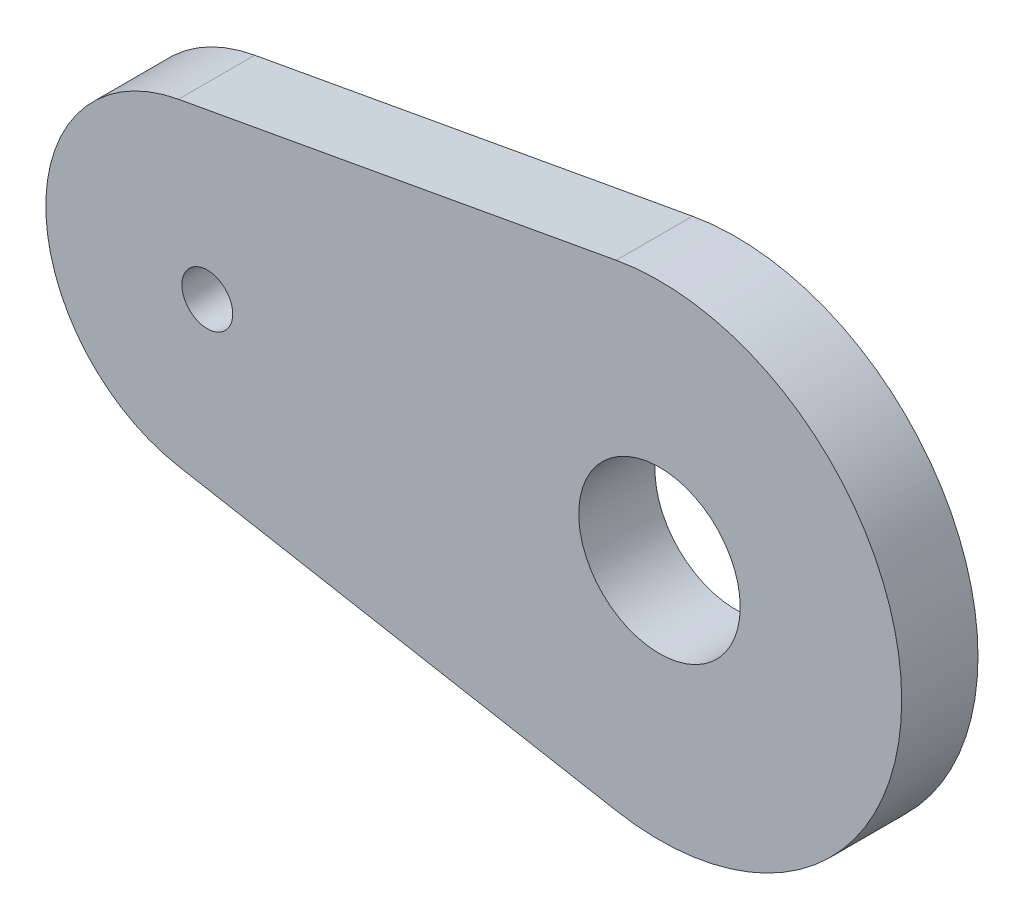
from build123d import *

# Parameters (mm, degrees)
SKETCH1_R           = 1
SKETCH1_R_2         = 3.175
BOSS_EXTRUDE1_DEPTH = 3


with BuildPart() as part:
    # Sketch1 → Boss-Extrude1 (new body)
    with BuildSketch(Plane.XY):
        with BuildLine():
            Line((-1.133928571, 6.247936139), (16.079107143, 9.371904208))
            ThreePointArc((16.079107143, 9.371904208), (27.305, 0), (16.079107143, -9.371904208))
            Line((16.079107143, -9.371904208), (-1.133928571, -6.247936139))
            ThreePointArc((-1.133928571, -6.247936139), (-6.35, 0), (-1.133928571, 6.247936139))
        make_face()
        Circle(SKETCH1_R, mode=Mode.SUBTRACT)
        with Locations((17.78, 0)):
            Circle(SKETCH1_R_2, mode=Mode.SUBTRACT)
    extrude(amount=BOSS_EXTRUDE1_DEPTH)


solid = part.part
